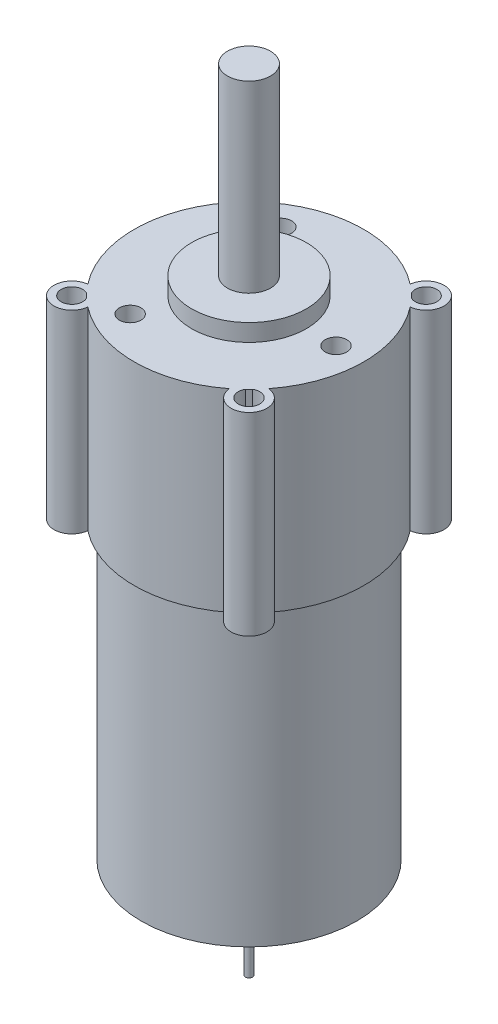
from build123d import *

# Parameters (mm, degrees)
SKETCH_1_R          = 16
SKETCH_1_R_2        = 1.5
EXTRUDE_1_DEPTH     = 27
SKETCH_2_R          = 15
EXTRUDE_2_DEPTH     = 55
EXTRUDE_START       = -27
EXTRUDE_3_DEPTH     = 27
CUT_EXTRUDE_START   = -14
SKETCH_4_R          = 15
SKETCH_4_R_2        = 0.5
CUT_EXTRUDE_1_DEPTH = 14
SKETCH_5_R          = 3
EXTRUDE_4_DEPTH     = 28
SKETCH_6_R          = 8
SKETCH_6_R_2        = 3
EXTRUDE_5_DEPTH     = 2.4


with BuildPart() as part:
    # Sketch 1 → Extrude 1 (new body)
    with BuildSketch(Plane(origin=(0, 0, 0), x_dir=(1, 0, 0), z_dir=(0, 1, 0))):
        with Locations(Location((0, 0, 0), (0, 0, 270))):
            Circle(SKETCH_1_R)
        with Locations(Location((-6.062177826, 10.5, 0), (0, 0, 270))):
            Circle(SKETCH_1_R_2, mode=Mode.SUBTRACT)
        with Locations(Location((-6.062177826, -10.5, 0), (0, 0, 270))):
            Circle(SKETCH_1_R_2, mode=Mode.SUBTRACT)
        with Locations(Location((12.124355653, 0, 0), (0, 0, 270))):
            Circle(SKETCH_1_R_2, mode=Mode.SUBTRACT)
    extrude(amount=EXTRUDE_1_DEPTH)

    # Sketch 2 → Extrude 2 (add)
    with BuildSketch(Plane(origin=(0, 0, 0), x_dir=(-1, 0, 0), z_dir=(0, -1, 0))):
        with Locations(Location((0, 0, 0), (0, 0, 270))):
            Circle(SKETCH_2_R)
    extrude(amount=EXTRUDE_2_DEPTH)

    # Sketch 3 → Extrude 3 (add)
    with BuildSketch(Plane(origin=(0, 27, 0), x_dir=(1, 0, 0), z_dir=(0, 1, 0)).offset(EXTRUDE_START)):
        with BuildLine():
            ThreePointArc((-11.050695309, 11.570744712), (-10.464815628, 12.103207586), (-9.853314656, 12.606037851))
            ThreePointArc((-9.853314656, 12.606037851), (-14.106780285, 14.106780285), (-12.606037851, 9.853314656))
            ThreePointArc((-12.606037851, 9.853314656), (-12.103207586, 10.464815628), (-11.570744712, 11.050695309))
            ThreePointArc((-11.570744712, 11.050695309), (-13.399673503, 13.399673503), (-11.050695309, 11.570744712))
        make_face()
        with BuildLine():
            ThreePointArc((11.050695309, 11.570744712), (13.399673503, 13.399673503), (11.570744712, 11.050695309))
            ThreePointArc((11.570744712, 11.050695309), (12.103207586, 10.464815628), (12.606037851, 9.853314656))
            ThreePointArc((12.606037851, 9.853314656), (14.106780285, 14.106780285), (9.853314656, 12.606037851))
            ThreePointArc((9.853314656, 12.606037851), (10.464815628, 12.103207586), (11.050695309, 11.570744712))
        make_face()
        with BuildLine():
            ThreePointArc((9.853314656, -12.606037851), (14.106780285, -14.106780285), (12.606037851, -9.853314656))
            ThreePointArc((12.606037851, -9.853314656), (12.103207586, -10.464815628), (11.570744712, -11.050695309))
            ThreePointArc((11.570744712, -11.050695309), (13.399673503, -13.399673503), (11.050695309, -11.570744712))
            ThreePointArc((11.050695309, -11.570744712), (10.464815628, -12.103207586), (9.853314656, -12.606037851))
        make_face()
        with BuildLine():
            ThreePointArc((-11.570744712, -11.050695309), (-12.103207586, -10.464815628), (-12.606037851, -9.853314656))
            ThreePointArc((-12.606037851, -9.853314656), (-14.106780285, -14.106780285), (-9.853314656, -12.606037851))
            ThreePointArc((-9.853314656, -12.606037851), (-10.464815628, -12.103207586), (-11.050695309, -11.570744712))
            ThreePointArc((-11.050695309, -11.570744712), (-13.399673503, -13.399673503), (-11.570744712, -11.050695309))
        make_face()
    extrude(amount=EXTRUDE_3_DEPTH)

    # Sketch 4 → Cut-Extrude 1 (cut)
    with BuildSketch(Plane.XZ.offset(55).offset(CUT_EXTRUDE_START)):
        with Locations(Location((0, 0, 0), (0, 0, 90))):
            Circle(SKETCH_4_R)
        with Locations(Location((0, 0, 0), (0, 0, 270))):
            Circle(SKETCH_4_R_2, mode=Mode.SUBTRACT)
    extrude(amount=CUT_EXTRUDE_1_DEPTH, mode=Mode.SUBTRACT)

    # Sketch 5 → Extrude 4 (add)
    with BuildSketch(Plane(origin=(0, 27, 0), x_dir=(1, 0, 0), z_dir=(0, 1, 0))):
        with Locations(Location((0, 0, 0), (0, 0, 270))):
            Circle(SKETCH_5_R)
    extrude(amount=EXTRUDE_4_DEPTH)

    # Sketch 6 → Extrude 5 (add)
    with BuildSketch(Plane(origin=(0, 27, 0), x_dir=(1, 0, 0), z_dir=(0, 1, 0))):
        with Locations(Location((0, 0, 0), (0, 0, 270))):
            Circle(SKETCH_6_R)
        with Locations(Location((0, 0, 0), (0, 0, 270))):
            Circle(SKETCH_6_R_2, mode=Mode.SUBTRACT)
    extrude(amount=EXTRUDE_5_DEPTH)


solid = part.part
